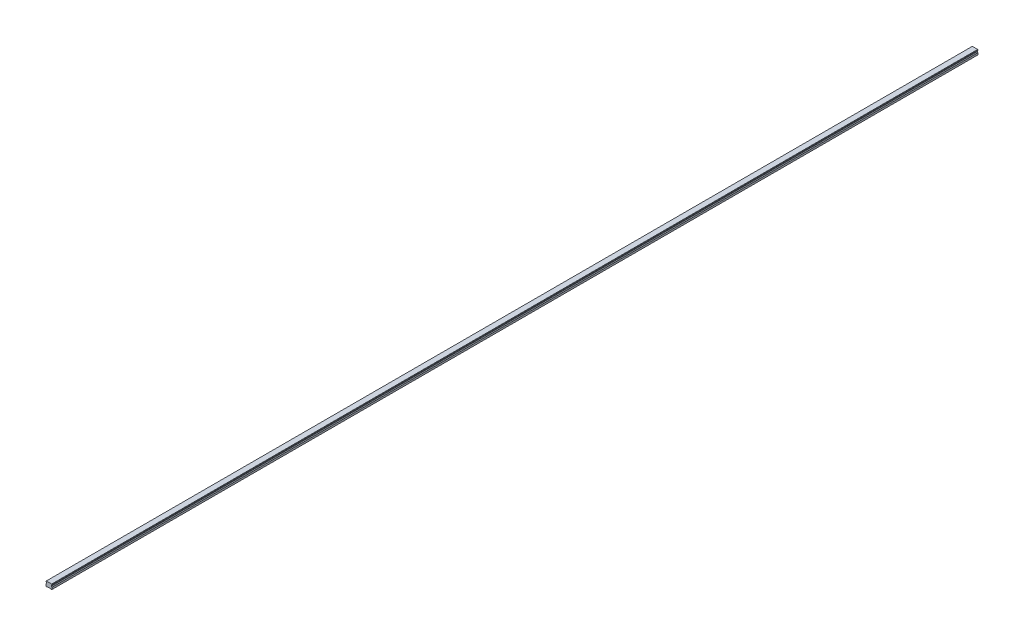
from build123d import *

# Parameters (mm, degrees)
SKETCH1_W           = 20
SKETCH1_H           = 16.3
BOSS_EXTRUDE1_DEPTH = 1550
CUT_EXTRUDE1_DEPTH  = 3101.058981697
CHAMFER1_SIZE       = 1
FILLET1_R           = 1
CUT_EXTRUDE2_DEPTH  = 3101.058981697
SKETCH5_R           = 3
SKETCH5_R_2         = 2.5
CUT_EXTRUDE5_DEPTH  = 10
SKETCH5_2_R         = 2.5
CUT_EXTRUDE6_DEPTH  = 13
LPATTERN2_COUNT     = 52
LPATTERN2_PITCH     = 60


with BuildPart() as part:
    # Sketch1 → Boss-Extrude1 (new, symmetric)
    with BuildSketch(Plane.XY):
        with Locations((0, 8.15)):
            Rectangle(SKETCH1_W, SKETCH1_H)
    extrude(amount=BOSS_EXTRUDE1_DEPTH, both=True)

    # Sketch2 → Cut-Extrude1 (cut, through all)
    with BuildSketch(Plane.XY.offset(1550)):
        Polygon((-10, 14.3), (-10, 7.3), (-7.666666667, 9.633333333), (-7.666666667, 11.966666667), align=None)
        Polygon((7.666666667, 11.966666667), (10, 14.3), (10, 7.3), (7.666666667, 9.633333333), align=None)
    extrude(amount=-CUT_EXTRUDE1_DEPTH, mode=Mode.SUBTRACT)

    # Chamfer1
    chamfer1_edges = [part.edges().sort_by_distance(p)[0] for p in [
        (-10, 16.3, 0),
        (10, 16.3, 0),
        (10, 0, 0),
        (-10, 0, 0),
    ]]
    chamfer(chamfer1_edges, length=CHAMFER1_SIZE)

    # Fillet1
    fillet1_edges = [part.edges().sort_by_distance(p)[0] for p in [
        (-7.666666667, 11.966666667, 0),
        (-7.666666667, 9.633333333, 0),
        (7.666666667, 9.633333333, 0),
        (7.666666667, 11.966666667, 0),
    ]]
    fillet(fillet1_edges, radius=FILLET1_R)

    # Sketch3 → Cut-Extrude2 (cut, through all)
    with BuildSketch(Plane.XY.offset(1550)):
        Polygon((-6, 0), (-5, 1), (5, 1), (6, 0), align=None)
    extrude(amount=-CUT_EXTRUDE2_DEPTH, mode=Mode.SUBTRACT)

    # Sketch5 → Cut-Extrude5 (cut)
    with BuildSketch(Plane.XZ.offset(-1)):
        with Locations(Location((0, 1530, 0), (0, 0, 270))):
            Circle(SKETCH5_R)
        with Locations(Location((0, 1530, 0), (0, 0, 270))):
            Circle(SKETCH5_R_2, mode=Mode.SUBTRACT)
    cut_extrude5 = extrude(amount=-CUT_EXTRUDE5_DEPTH, mode=Mode.SUBTRACT)

    # Sketch5_2 → Cut-Extrude6 (cut)
    with BuildSketch(Plane.XZ.offset(-1)):
        with Locations(Location((0, 1530, 0), (0, 0, 270))):
            Circle(SKETCH5_2_R)
    cut_extrude6 = extrude(amount=-CUT_EXTRUDE6_DEPTH, mode=Mode.SUBTRACT)

    # Cut-Extrude7 cone 1 section (on through the dimple's axis) → Cut-Extrude7 (revolve, cut)
    with BuildSketch(Plane(origin=(0, 14, 1530), x_dir=(0, 0, -1), z_dir=(1, 0, 0))):
        Polygon((0, 0), (2.5, 0), (0, 1.443375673), align=None)
    cut_extrude7 = revolve(axis=Axis((0, 14, 1530), (0, 1, 0)), mode=Mode.SUBTRACT)

    # LPattern2: Cut-Extrude5, Cut-Extrude6, Cut-Extrude7 ×52
    with Locations(*[(0, 0, -i * LPATTERN2_PITCH) for i in range(1, LPATTERN2_COUNT)]):
        add(cut_extrude5, mode=Mode.SUBTRACT)
        add(cut_extrude6, mode=Mode.SUBTRACT)
        add(cut_extrude7, mode=Mode.SUBTRACT)


solid = part.part
